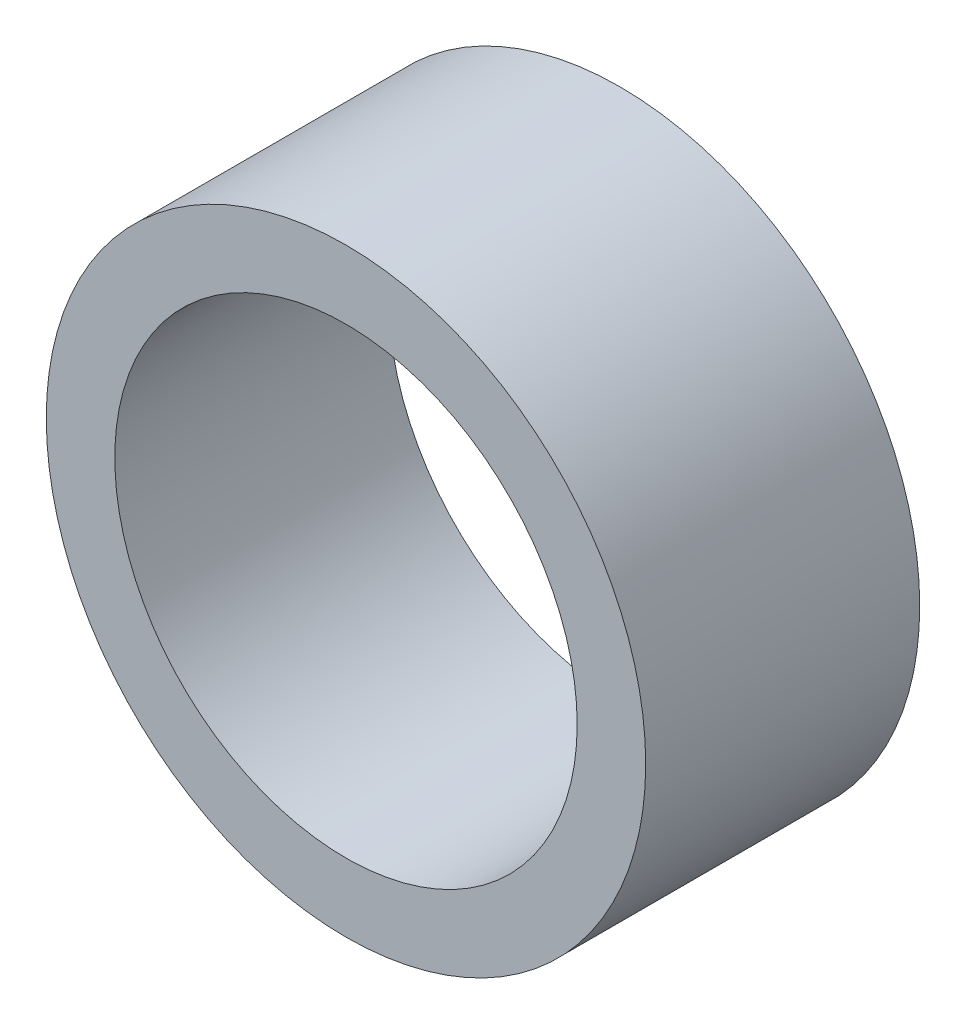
ISO-10303-21;
HEADER;
FILE_DESCRIPTION(('STEP AP214'),'2;1');
FILE_NAME('part.step','',(''),(''),'','','');
FILE_SCHEMA(('AUTOMOTIVE_DESIGN { 1 0 10303 214 1 1 1 1 }'));
ENDSEC;
DATA;
#1=APPLICATION_CONTEXT('core data for automotive mechanical design processes');
#2=APPLICATION_PROTOCOL_DEFINITION('international standard','automotive_design',2000,#1);
#3=PRODUCT_CONTEXT('',#1,'mechanical');
#4=PRODUCT('Part','Part','',(#3));
#5=PRODUCT_RELATED_PRODUCT_CATEGORY('part','',(#4));
#6=PRODUCT_DEFINITION_FORMATION('','',#4);
#7=PRODUCT_DEFINITION_CONTEXT('part definition',#1,'design');
#8=PRODUCT_DEFINITION('design','',#6,#7);
#9=PRODUCT_DEFINITION_SHAPE('','',#8);
#10=(LENGTH_UNIT() NAMED_UNIT(*) SI_UNIT(.MILLI.,.METRE.));
#11=(NAMED_UNIT(*) PLANE_ANGLE_UNIT() SI_UNIT($,.RADIAN.));
#12=(NAMED_UNIT(*) SI_UNIT($,.STERADIAN.) SOLID_ANGLE_UNIT());
#13=UNCERTAINTY_MEASURE_WITH_UNIT(LENGTH_MEASURE(1.E-05),#10,'distance_accuracy_value','');
#14=(GEOMETRIC_REPRESENTATION_CONTEXT(3) GLOBAL_UNCERTAINTY_ASSIGNED_CONTEXT((#13)) GLOBAL_UNIT_ASSIGNED_CONTEXT((#10,
#11,#12)) REPRESENTATION_CONTEXT('',''));
#15=CARTESIAN_POINT('',(0.,0.,0.));
#16=DIRECTION('',(0.,0.,1.));
#17=DIRECTION('',(1.,0.,0.));
#18=AXIS2_PLACEMENT_3D('',#15,#16,#17);
#19=CARTESIAN_POINT('',(0.,0.,16.));
#20=DIRECTION('',(0.,0.,-1.));
#21=DIRECTION('',(-1.,0.,0.));
#22=AXIS2_PLACEMENT_3D('',#19,#20,#21);
#23=CYLINDRICAL_SURFACE('',#22,17.5);
#24=CARTESIAN_POINT('',(0.,0.,16.));
#25=DIRECTION('',(0.,0.,1.));
#26=DIRECTION('',(1.,0.,0.));
#27=AXIS2_PLACEMENT_3D('',#24,#25,#26);
#28=CIRCLE('',#27,17.5);
#29=CARTESIAN_POINT('',(17.5,0.,16.));
#30=VERTEX_POINT('',#29);
#31=EDGE_CURVE('E10',#30,#30,#28,.T.);
#32=ORIENTED_EDGE('',*,*,#31,.F.);
#33=EDGE_LOOP('',(#32));
#34=FACE_BOUND('',#33,.T.);
#35=CARTESIAN_POINT('',(0.,0.,0.));
#36=DIRECTION('',(0.,0.,1.));
#37=DIRECTION('',(1.,0.,0.));
#38=AXIS2_PLACEMENT_3D('',#35,#36,#37);
#39=CIRCLE('',#38,17.5);
#40=CARTESIAN_POINT('',(17.5,0.,0.));
#41=VERTEX_POINT('',#40);
#42=EDGE_CURVE('E36',#41,#41,#39,.T.);
#43=ORIENTED_EDGE('',*,*,#42,.T.);
#44=EDGE_LOOP('',(#43));
#45=FACE_BOUND('',#44,.T.);
#46=ADVANCED_FACE('F29',(#34,#45),#23,.T.);
#47=CARTESIAN_POINT('',(0.,0.,16.));
#48=DIRECTION('',(0.,0.,1.));
#49=DIRECTION('',(1.,0.,0.));
#50=AXIS2_PLACEMENT_3D('',#47,#48,#49);
#51=PLANE('',#50);
#52=CARTESIAN_POINT('',(0.,0.,16.));
#53=DIRECTION('',(0.,0.,1.));
#54=DIRECTION('',(1.,0.,0.));
#55=AXIS2_PLACEMENT_3D('',#52,#53,#54);
#56=CIRCLE('',#55,13.5);
#57=CARTESIAN_POINT('',(13.5,0.,16.));
#58=VERTEX_POINT('',#57);
#59=EDGE_CURVE('E42',#58,#58,#56,.T.);
#60=ORIENTED_EDGE('',*,*,#59,.F.);
#61=EDGE_LOOP('',(#60));
#62=FACE_BOUND('',#61,.T.);
#63=ORIENTED_EDGE('',*,*,#31,.T.);
#64=EDGE_LOOP('',(#63));
#65=FACE_BOUND('',#64,.T.);
#66=ADVANCED_FACE('F58',(#62,#65),#51,.T.);
#67=CARTESIAN_POINT('',(0.,0.,0.));
#68=DIRECTION('',(0.,0.,1.));
#69=DIRECTION('',(1.,0.,0.));
#70=AXIS2_PLACEMENT_3D('',#67,#68,#69);
#71=PLANE('',#70);
#72=CARTESIAN_POINT('',(0.,0.,0.));
#73=DIRECTION('',(0.,0.,1.));
#74=DIRECTION('',(1.,0.,0.));
#75=AXIS2_PLACEMENT_3D('',#72,#73,#74);
#76=CIRCLE('',#75,13.5);
#77=CARTESIAN_POINT('',(13.5,0.,0.));
#78=VERTEX_POINT('',#77);
#79=EDGE_CURVE('E32',#78,#78,#76,.T.);
#80=ORIENTED_EDGE('',*,*,#79,.T.);
#81=EDGE_LOOP('',(#80));
#82=FACE_BOUND('',#81,.T.);
#83=ORIENTED_EDGE('',*,*,#42,.F.);
#84=EDGE_LOOP('',(#83));
#85=FACE_BOUND('',#84,.T.);
#86=ADVANCED_FACE('F49',(#82,#85),#71,.F.);
#87=CARTESIAN_POINT('',(0.,0.,-14.));
#88=DIRECTION('',(0.,0.,1.));
#89=DIRECTION('',(1.,0.,0.));
#90=AXIS2_PLACEMENT_3D('',#87,#88,#89);
#91=CYLINDRICAL_SURFACE('',#90,13.5);
#92=ORIENTED_EDGE('',*,*,#59,.T.);
#93=EDGE_LOOP('',(#92));
#94=FACE_BOUND('',#93,.T.);
#95=ORIENTED_EDGE('',*,*,#79,.F.);
#96=EDGE_LOOP('',(#95));
#97=FACE_BOUND('',#96,.T.);
#98=ADVANCED_FACE('F52',(#94,#97),#91,.F.);
#99=CLOSED_SHELL('',(#46,#66,#86,#98));
#100=MANIFOLD_SOLID_BREP('B2',#99);
#101=ADVANCED_BREP_SHAPE_REPRESENTATION('',(#18,#100),#14);
#102=SHAPE_DEFINITION_REPRESENTATION(#9,#101);
ENDSEC;
END-ISO-10303-21;
